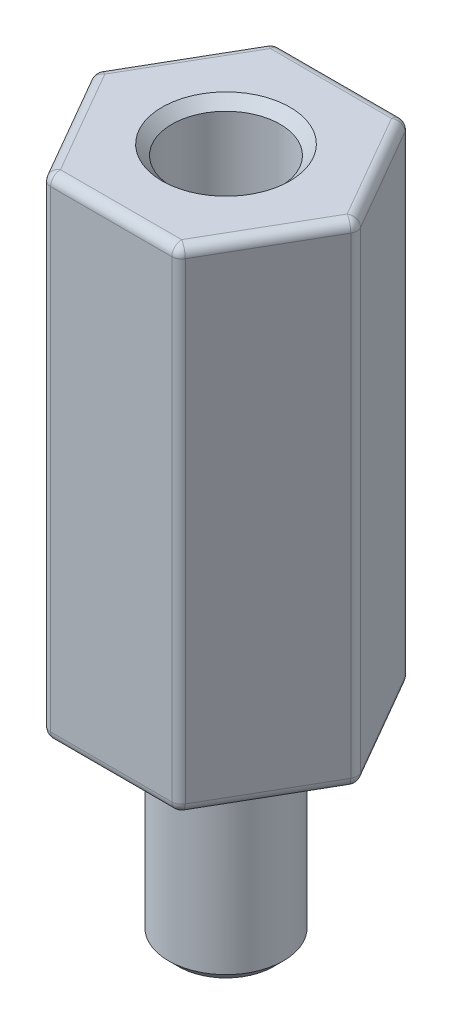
ISO-10303-21;
HEADER;
FILE_DESCRIPTION(('STEP AP214'),'2;1');
FILE_NAME('part.step','',(''),(''),'','','');
FILE_SCHEMA(('AUTOMOTIVE_DESIGN { 1 0 10303 214 1 1 1 1 }'));
ENDSEC;
DATA;
#1=APPLICATION_CONTEXT('core data for automotive mechanical design processes');
#2=APPLICATION_PROTOCOL_DEFINITION('international standard','automotive_design',2000,#1);
#3=PRODUCT_CONTEXT('',#1,'mechanical');
#4=PRODUCT('Part','Part','',(#3));
#5=PRODUCT_RELATED_PRODUCT_CATEGORY('part','',(#4));
#6=PRODUCT_DEFINITION_FORMATION('','',#4);
#7=PRODUCT_DEFINITION_CONTEXT('part definition',#1,'design');
#8=PRODUCT_DEFINITION('design','',#6,#7);
#9=PRODUCT_DEFINITION_SHAPE('','',#8);
#10=(LENGTH_UNIT() NAMED_UNIT(*) SI_UNIT(.MILLI.,.METRE.));
#11=(NAMED_UNIT(*) PLANE_ANGLE_UNIT() SI_UNIT($,.RADIAN.));
#12=(NAMED_UNIT(*) SI_UNIT($,.STERADIAN.) SOLID_ANGLE_UNIT());
#13=UNCERTAINTY_MEASURE_WITH_UNIT(LENGTH_MEASURE(1.E-05),#10,'distance_accuracy_value','');
#14=(GEOMETRIC_REPRESENTATION_CONTEXT(3) GLOBAL_UNCERTAINTY_ASSIGNED_CONTEXT((#13)) GLOBAL_UNIT_ASSIGNED_CONTEXT((#10,
#11,#12)) REPRESENTATION_CONTEXT('',''));
#15=CARTESIAN_POINT('',(0.,0.,0.));
#16=DIRECTION('',(0.,0.,1.));
#17=DIRECTION('',(1.,0.,0.));
#18=AXIS2_PLACEMENT_3D('',#15,#16,#17);
#19=CARTESIAN_POINT('',(0.,15.,0.));
#20=DIRECTION('',(0.,1.,0.));
#21=DIRECTION('',(0.,0.,1.));
#22=AXIS2_PLACEMENT_3D('',#19,#20,#21);
#23=PLANE('',#22);
#24=CARTESIAN_POINT('',(0.,15.,0.));
#25=DIRECTION('',(0.,1.,0.));
#26=DIRECTION('',(0.,0.,1.));
#27=AXIS2_PLACEMENT_3D('',#24,#25,#26);
#28=CIRCLE('',#27,1.95);
#29=CARTESIAN_POINT('',(0.,15.,1.95));
#30=VERTEX_POINT('',#29);
#31=EDGE_CURVE('E319',#30,#30,#28,.F.);
#32=ORIENTED_EDGE('',*,*,#31,.T.);
#33=EDGE_LOOP('',(#32));
#34=FACE_BOUND('',#33,.T.);
#35=DIRECTION('',(-0.5,0.,0.866025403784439));
#36=VECTOR('',#35,1.);
#37=CARTESIAN_POINT('',(-3.6950417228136,15.,0.));
#38=LINE('',#37,#36);
#39=CARTESIAN_POINT('',(-1.8475208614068,15.,-3.2));
#40=VERTEX_POINT('',#39);
#41=CARTESIAN_POINT('',(-3.6950417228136,15.,0.));
#42=VERTEX_POINT('',#41);
#43=EDGE_CURVE('E63',#40,#42,#38,.T.);
#44=ORIENTED_EDGE('',*,*,#43,.T.);
#45=DIRECTION('',(0.5,0.,0.866025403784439));
#46=VECTOR('',#45,1.);
#47=CARTESIAN_POINT('',(-1.8475208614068,15.,3.2));
#48=LINE('',#47,#46);
#49=CARTESIAN_POINT('',(-1.8475208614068,15.,3.2));
#50=VERTEX_POINT('',#49);
#51=EDGE_CURVE('E646',#42,#50,#48,.T.);
#52=ORIENTED_EDGE('',*,*,#51,.T.);
#53=DIRECTION('',(1.,0.,0.));
#54=VECTOR('',#53,1.);
#55=CARTESIAN_POINT('',(1.8475208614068,15.,3.2));
#56=LINE('',#55,#54);
#57=CARTESIAN_POINT('',(1.8475208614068,15.,3.2));
#58=VERTEX_POINT('',#57);
#59=EDGE_CURVE('E633',#50,#58,#56,.T.);
#60=ORIENTED_EDGE('',*,*,#59,.T.);
#61=DIRECTION('',(0.5,0.,-0.866025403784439));
#62=VECTOR('',#61,1.);
#63=CARTESIAN_POINT('',(3.69504172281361,15.,0.));
#64=LINE('',#63,#62);
#65=CARTESIAN_POINT('',(3.69504172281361,15.,0.));
#66=VERTEX_POINT('',#65);
#67=EDGE_CURVE('E636',#58,#66,#64,.T.);
#68=ORIENTED_EDGE('',*,*,#67,.T.);
#69=DIRECTION('',(-0.5,0.,-0.866025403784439));
#70=VECTOR('',#69,1.);
#71=CARTESIAN_POINT('',(1.8475208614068,15.,-3.2));
#72=LINE('',#71,#70);
#73=CARTESIAN_POINT('',(1.8475208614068,15.,-3.2));
#74=VERTEX_POINT('',#73);
#75=EDGE_CURVE('E639',#66,#74,#72,.T.);
#76=ORIENTED_EDGE('',*,*,#75,.T.);
#77=DIRECTION('',(-1.,0.,0.));
#78=VECTOR('',#77,1.);
#79=CARTESIAN_POINT('',(-1.8475208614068,15.,-3.2));
#80=LINE('',#79,#78);
#81=EDGE_CURVE('E68',#74,#40,#80,.T.);
#82=ORIENTED_EDGE('',*,*,#81,.T.);
#83=EDGE_LOOP('',(#44,#52,#60,#68,#76,#82));
#84=FACE_BOUND('',#83,.T.);
#85=ADVANCED_FACE('F47',(#34,#84),#23,.T.);
#86=CARTESIAN_POINT('',(0.,0.,0.));
#87=DIRECTION('',(0.,1.,0.));
#88=DIRECTION('',(0.,0.,1.));
#89=AXIS2_PLACEMENT_3D('',#86,#87,#88);
#90=PLANE('',#89);
#91=CARTESIAN_POINT('',(0.,0.,0.));
#92=DIRECTION('',(0.,1.,0.));
#93=DIRECTION('',(0.,0.,1.));
#94=AXIS2_PLACEMENT_3D('',#91,#92,#93);
#95=CIRCLE('',#94,2.05);
#96=CARTESIAN_POINT('',(0.,0.,2.05));
#97=VERTEX_POINT('',#96);
#98=EDGE_CURVE('E11',#97,#97,#95,.T.);
#99=ORIENTED_EDGE('',*,*,#98,.T.);
#100=EDGE_LOOP('',(#99));
#101=FACE_BOUND('',#100,.T.);
#102=DIRECTION('',(1.,0.,0.));
#103=VECTOR('',#102,1.);
#104=CARTESIAN_POINT('',(0.,0.,3.2));
#105=LINE('',#104,#103);
#106=CARTESIAN_POINT('',(1.8475208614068,0.,3.2));
#107=VERTEX_POINT('',#106);
#108=CARTESIAN_POINT('',(-1.8475208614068,0.,3.2));
#109=VERTEX_POINT('',#108);
#110=EDGE_CURVE('E184',#107,#109,#105,.F.);
#111=ORIENTED_EDGE('',*,*,#110,.T.);
#112=DIRECTION('',(0.5,0.,0.866025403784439));
#113=VECTOR('',#112,1.);
#114=CARTESIAN_POINT('',(-2.7712812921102,0.,1.6));
#115=LINE('',#114,#113);
#116=CARTESIAN_POINT('',(-3.6950417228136,0.,0.));
#117=VERTEX_POINT('',#116);
#118=EDGE_CURVE('E212',#109,#117,#115,.F.);
#119=ORIENTED_EDGE('',*,*,#118,.T.);
#120=DIRECTION('',(-0.5,0.,0.866025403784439));
#121=VECTOR('',#120,1.);
#122=CARTESIAN_POINT('',(-2.7712812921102,0.,-1.6));
#123=LINE('',#122,#121);
#124=CARTESIAN_POINT('',(-1.8475208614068,0.,-3.2));
#125=VERTEX_POINT('',#124);
#126=EDGE_CURVE('E574',#117,#125,#123,.F.);
#127=ORIENTED_EDGE('',*,*,#126,.T.);
#128=DIRECTION('',(-1.,0.,0.));
#129=VECTOR('',#128,1.);
#130=CARTESIAN_POINT('',(0.,0.,-3.2));
#131=LINE('',#130,#129);
#132=CARTESIAN_POINT('',(1.8475208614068,0.,-3.2));
#133=VERTEX_POINT('',#132);
#134=EDGE_CURVE('E571',#125,#133,#131,.F.);
#135=ORIENTED_EDGE('',*,*,#134,.T.);
#136=DIRECTION('',(-0.5,0.,-0.866025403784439));
#137=VECTOR('',#136,1.);
#138=CARTESIAN_POINT('',(2.7712812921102,0.,-1.6));
#139=LINE('',#138,#137);
#140=CARTESIAN_POINT('',(3.69504172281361,0.,0.));
#141=VERTEX_POINT('',#140);
#142=EDGE_CURVE('E568',#133,#141,#139,.F.);
#143=ORIENTED_EDGE('',*,*,#142,.T.);
#144=DIRECTION('',(0.5,0.,-0.866025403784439));
#145=VECTOR('',#144,1.);
#146=CARTESIAN_POINT('',(2.7712812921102,0.,1.6));
#147=LINE('',#146,#145);
#148=EDGE_CURVE('E565',#141,#107,#147,.F.);
#149=ORIENTED_EDGE('',*,*,#148,.T.);
#150=EDGE_LOOP('',(#111,#119,#127,#135,#143,#149));
#151=FACE_BOUND('',#150,.T.);
#152=ADVANCED_FACE('F339',(#101,#151),#90,.F.);
#153=CARTESIAN_POINT('',(2.02072594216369,15.,-3.5));
#154=DIRECTION('',(0.,0.,1.));
#155=DIRECTION('',(1.,0.,0.));
#156=AXIS2_PLACEMENT_3D('',#153,#154,#155);
#157=PLANE('',#156);
#158=DIRECTION('',(0.,-1.,0.));
#159=VECTOR('',#158,1.);
#160=CARTESIAN_POINT('',(1.8475208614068,15.,-3.5));
#161=LINE('',#160,#159);
#162=CARTESIAN_POINT('',(1.8475208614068,14.7,-3.5));
#163=VERTEX_POINT('',#162);
#164=CARTESIAN_POINT('',(1.8475208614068,0.3,-3.5));
#165=VERTEX_POINT('',#164);
#166=EDGE_CURVE('E521',#163,#165,#161,.T.);
#167=ORIENTED_EDGE('',*,*,#166,.T.);
#168=DIRECTION('',(-1.,0.,0.));
#169=VECTOR('',#168,1.);
#170=CARTESIAN_POINT('',(2.02072594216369,0.3,-3.5));
#171=LINE('',#170,#169);
#172=CARTESIAN_POINT('',(-1.8475208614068,0.3,-3.5));
#173=VERTEX_POINT('',#172);
#174=EDGE_CURVE('E600',#165,#173,#171,.T.);
#175=ORIENTED_EDGE('',*,*,#174,.T.);
#176=DIRECTION('',(0.,-1.,0.));
#177=VECTOR('',#176,1.);
#178=CARTESIAN_POINT('',(-1.8475208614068,15.,-3.5));
#179=LINE('',#178,#177);
#180=CARTESIAN_POINT('',(-1.8475208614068,14.7,-3.5));
#181=VERTEX_POINT('',#180);
#182=EDGE_CURVE('E517',#173,#181,#179,.F.);
#183=ORIENTED_EDGE('',*,*,#182,.T.);
#184=DIRECTION('',(-1.,0.,0.));
#185=VECTOR('',#184,1.);
#186=CARTESIAN_POINT('',(1.8475208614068,14.7,-3.5));
#187=LINE('',#186,#185);
#188=EDGE_CURVE('E597',#181,#163,#187,.F.);
#189=ORIENTED_EDGE('',*,*,#188,.T.);
#190=EDGE_LOOP('',(#167,#175,#183,#189));
#191=FACE_BOUND('',#190,.T.);
#192=ADVANCED_FACE('F345',(#191),#157,.F.);
#193=CARTESIAN_POINT('',(-2.02072594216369,15.,-3.5));
#194=DIRECTION('',(0.866025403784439,0.,0.5));
#195=DIRECTION('',(0.5,0.,-0.866025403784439));
#196=AXIS2_PLACEMENT_3D('',#193,#194,#195);
#197=PLANE('',#196);
#198=DIRECTION('',(0.,-1.,0.));
#199=VECTOR('',#198,1.);
#200=CARTESIAN_POINT('',(-2.10732848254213,15.,-3.35));
#201=LINE('',#200,#199);
#202=CARTESIAN_POINT('',(-2.10732848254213,14.7,-3.35));
#203=VERTEX_POINT('',#202);
#204=CARTESIAN_POINT('',(-2.10732848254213,0.3,-3.35));
#205=VERTEX_POINT('',#204);
#206=EDGE_CURVE('E198',#203,#205,#201,.T.);
#207=ORIENTED_EDGE('',*,*,#206,.T.);
#208=DIRECTION('',(-0.5,0.,0.866025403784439));
#209=VECTOR('',#208,1.);
#210=CARTESIAN_POINT('',(-2.02072594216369,0.3,-3.5));
#211=LINE('',#210,#209);
#212=CARTESIAN_POINT('',(-3.95484934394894,0.3,-0.149999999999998));
#213=VERTEX_POINT('',#212);
#214=EDGE_CURVE('E588',#205,#213,#211,.T.);
#215=ORIENTED_EDGE('',*,*,#214,.T.);
#216=DIRECTION('',(0.,-1.,0.));
#217=VECTOR('',#216,1.);
#218=CARTESIAN_POINT('',(-3.95484934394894,15.,-0.149999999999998));
#219=LINE('',#218,#217);
#220=CARTESIAN_POINT('',(-3.95484934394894,14.7,-0.149999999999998));
#221=VERTEX_POINT('',#220);
#222=EDGE_CURVE('E543',#213,#221,#219,.F.);
#223=ORIENTED_EDGE('',*,*,#222,.T.);
#224=DIRECTION('',(-0.5,0.,0.866025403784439));
#225=VECTOR('',#224,1.);
#226=CARTESIAN_POINT('',(-2.10732848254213,14.7,-3.35));
#227=LINE('',#226,#225);
#228=EDGE_CURVE('E585',#221,#203,#227,.F.);
#229=ORIENTED_EDGE('',*,*,#228,.T.);
#230=EDGE_LOOP('',(#207,#215,#223,#229));
#231=FACE_BOUND('',#230,.T.);
#232=ADVANCED_FACE('F366',(#231),#197,.F.);
#233=CARTESIAN_POINT('',(-4.04145188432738,15.,0.));
#234=DIRECTION('',(0.866025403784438,0.,-0.5));
#235=DIRECTION('',(-0.5,0.,-0.866025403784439));
#236=AXIS2_PLACEMENT_3D('',#233,#234,#235);
#237=PLANE('',#236);
#238=DIRECTION('',(0.,-1.,0.));
#239=VECTOR('',#238,1.);
#240=CARTESIAN_POINT('',(-3.95484934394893,15.,0.150000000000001));
#241=LINE('',#240,#239);
#242=CARTESIAN_POINT('',(-3.95484934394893,14.7,0.150000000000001));
#243=VERTEX_POINT('',#242);
#244=CARTESIAN_POINT('',(-3.95484934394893,0.3,0.150000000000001));
#245=VERTEX_POINT('',#244);
#246=EDGE_CURVE('E179',#243,#245,#241,.T.);
#247=ORIENTED_EDGE('',*,*,#246,.T.);
#248=DIRECTION('',(0.5,0.,0.866025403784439));
#249=VECTOR('',#248,1.);
#250=CARTESIAN_POINT('',(-4.04145188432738,0.3,0.));
#251=LINE('',#250,#249);
#252=CARTESIAN_POINT('',(-2.10732848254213,0.3,3.35));
#253=VERTEX_POINT('',#252);
#254=EDGE_CURVE('E174',#245,#253,#251,.T.);
#255=ORIENTED_EDGE('',*,*,#254,.T.);
#256=DIRECTION('',(0.,-1.,0.));
#257=VECTOR('',#256,1.);
#258=CARTESIAN_POINT('',(-2.10732848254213,15.,3.35));
#259=LINE('',#258,#257);
#260=CARTESIAN_POINT('',(-2.10732848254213,14.7,3.35));
#261=VERTEX_POINT('',#260);
#262=EDGE_CURVE('E177',#253,#261,#259,.F.);
#263=ORIENTED_EDGE('',*,*,#262,.T.);
#264=DIRECTION('',(0.5,0.,0.866025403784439));
#265=VECTOR('',#264,1.);
#266=CARTESIAN_POINT('',(-3.95484934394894,14.7,0.150000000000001));
#267=LINE('',#266,#265);
#268=EDGE_CURVE('E185',#261,#243,#267,.F.);
#269=ORIENTED_EDGE('',*,*,#268,.T.);
#270=EDGE_LOOP('',(#247,#255,#263,#269));
#271=FACE_BOUND('',#270,.T.);
#272=ADVANCED_FACE('F176',(#271),#237,.F.);
#273=CARTESIAN_POINT('',(-2.02072594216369,15.,3.5));
#274=DIRECTION('',(0.,0.,-1.));
#275=DIRECTION('',(-1.,0.,0.));
#276=AXIS2_PLACEMENT_3D('',#273,#274,#275);
#277=PLANE('',#276);
#278=DIRECTION('',(0.,-1.,0.));
#279=VECTOR('',#278,1.);
#280=CARTESIAN_POINT('',(-1.8475208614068,15.,3.5));
#281=LINE('',#280,#279);
#282=CARTESIAN_POINT('',(-1.8475208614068,14.7,3.5));
#283=VERTEX_POINT('',#282);
#284=CARTESIAN_POINT('',(-1.8475208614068,0.3,3.5));
#285=VERTEX_POINT('',#284);
#286=EDGE_CURVE('E556',#283,#285,#281,.T.);
#287=ORIENTED_EDGE('',*,*,#286,.T.);
#288=DIRECTION('',(1.,0.,0.));
#289=VECTOR('',#288,1.);
#290=CARTESIAN_POINT('',(-2.02072594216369,0.3,3.5));
#291=LINE('',#290,#289);
#292=CARTESIAN_POINT('',(1.8475208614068,0.3,3.5));
#293=VERTEX_POINT('',#292);
#294=EDGE_CURVE('E224',#285,#293,#291,.T.);
#295=ORIENTED_EDGE('',*,*,#294,.T.);
#296=DIRECTION('',(0.,-1.,0.));
#297=VECTOR('',#296,1.);
#298=CARTESIAN_POINT('',(1.8475208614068,15.,3.5));
#299=LINE('',#298,#297);
#300=CARTESIAN_POINT('',(1.8475208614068,14.7,3.5));
#301=VERTEX_POINT('',#300);
#302=EDGE_CURVE('E552',#293,#301,#299,.F.);
#303=ORIENTED_EDGE('',*,*,#302,.T.);
#304=DIRECTION('',(1.,0.,0.));
#305=VECTOR('',#304,1.);
#306=CARTESIAN_POINT('',(-1.8475208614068,14.7,3.5));
#307=LINE('',#306,#305);
#308=EDGE_CURVE('E648',#301,#283,#307,.F.);
#309=ORIENTED_EDGE('',*,*,#308,.T.);
#310=EDGE_LOOP('',(#287,#295,#303,#309));
#311=FACE_BOUND('',#310,.T.);
#312=ADVANCED_FACE('F359',(#311),#277,.F.);
#313=CARTESIAN_POINT('',(2.02072594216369,15.,3.5));
#314=DIRECTION('',(-0.866025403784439,0.,-0.5));
#315=DIRECTION('',(-0.5,0.,0.866025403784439));
#316=AXIS2_PLACEMENT_3D('',#313,#314,#315);
#317=PLANE('',#316);
#318=DIRECTION('',(0.,-1.,0.));
#319=VECTOR('',#318,1.);
#320=CARTESIAN_POINT('',(2.10732848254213,15.,3.35));
#321=LINE('',#320,#319);
#322=CARTESIAN_POINT('',(2.10732848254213,14.7,3.35));
#323=VERTEX_POINT('',#322);
#324=CARTESIAN_POINT('',(2.10732848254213,0.3,3.35));
#325=VERTEX_POINT('',#324);
#326=EDGE_CURVE('E535',#323,#325,#321,.T.);
#327=ORIENTED_EDGE('',*,*,#326,.T.);
#328=DIRECTION('',(0.5,0.,-0.866025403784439));
#329=VECTOR('',#328,1.);
#330=CARTESIAN_POINT('',(2.02072594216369,0.3,3.5));
#331=LINE('',#330,#329);
#332=CARTESIAN_POINT('',(3.95484934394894,0.3,0.15));
#333=VERTEX_POINT('',#332);
#334=EDGE_CURVE('E624',#325,#333,#331,.T.);
#335=ORIENTED_EDGE('',*,*,#334,.T.);
#336=DIRECTION('',(0.,-1.,0.));
#337=VECTOR('',#336,1.);
#338=CARTESIAN_POINT('',(3.95484934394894,15.,0.15));
#339=LINE('',#338,#337);
#340=CARTESIAN_POINT('',(3.95484934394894,14.7,0.15));
#341=VERTEX_POINT('',#340);
#342=EDGE_CURVE('E539',#333,#341,#339,.F.);
#343=ORIENTED_EDGE('',*,*,#342,.T.);
#344=DIRECTION('',(0.5,0.,-0.866025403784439));
#345=VECTOR('',#344,1.);
#346=CARTESIAN_POINT('',(2.10732848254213,14.7,3.35));
#347=LINE('',#346,#345);
#348=EDGE_CURVE('E621',#341,#323,#347,.F.);
#349=ORIENTED_EDGE('',*,*,#348,.T.);
#350=EDGE_LOOP('',(#327,#335,#343,#349));
#351=FACE_BOUND('',#350,.T.);
#352=ADVANCED_FACE('F355',(#351),#317,.F.);
#353=CARTESIAN_POINT('',(4.04145188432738,15.,0.));
#354=DIRECTION('',(-0.866025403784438,0.,0.5));
#355=DIRECTION('',(0.5,0.,0.866025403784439));
#356=AXIS2_PLACEMENT_3D('',#353,#354,#355);
#357=PLANE('',#356);
#358=DIRECTION('',(0.,-1.,0.));
#359=VECTOR('',#358,1.);
#360=CARTESIAN_POINT('',(3.95484934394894,15.,-0.15));
#361=LINE('',#360,#359);
#362=CARTESIAN_POINT('',(3.95484934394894,14.7,-0.15));
#363=VERTEX_POINT('',#362);
#364=CARTESIAN_POINT('',(3.95484934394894,0.3,-0.15));
#365=VERTEX_POINT('',#364);
#366=EDGE_CURVE('E527',#363,#365,#361,.T.);
#367=ORIENTED_EDGE('',*,*,#366,.T.);
#368=DIRECTION('',(-0.5,0.,-0.866025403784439));
#369=VECTOR('',#368,1.);
#370=CARTESIAN_POINT('',(4.04145188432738,0.3,0.));
#371=LINE('',#370,#369);
#372=CARTESIAN_POINT('',(2.10732848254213,0.3,-3.35));
#373=VERTEX_POINT('',#372);
#374=EDGE_CURVE('E612',#365,#373,#371,.T.);
#375=ORIENTED_EDGE('',*,*,#374,.T.);
#376=DIRECTION('',(0.,-1.,0.));
#377=VECTOR('',#376,1.);
#378=CARTESIAN_POINT('',(2.10732848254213,15.,-3.35));
#379=LINE('',#378,#377);
#380=CARTESIAN_POINT('',(2.10732848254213,14.7,-3.35));
#381=VERTEX_POINT('',#380);
#382=EDGE_CURVE('E531',#373,#381,#379,.F.);
#383=ORIENTED_EDGE('',*,*,#382,.T.);
#384=DIRECTION('',(-0.5,0.,-0.866025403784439));
#385=VECTOR('',#384,1.);
#386=CARTESIAN_POINT('',(3.95484934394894,14.7,-0.15));
#387=LINE('',#386,#385);
#388=EDGE_CURVE('E609',#381,#363,#387,.F.);
#389=ORIENTED_EDGE('',*,*,#388,.T.);
#390=EDGE_LOOP('',(#367,#375,#383,#389));
#391=FACE_BOUND('',#390,.T.);
#392=ADVANCED_FACE('F352',(#391),#357,.F.);
#393=CARTESIAN_POINT('',(0.,15.,0.));
#394=DIRECTION('',(0.,-1.,0.));
#395=DIRECTION('',(0.,0.,-1.));
#396=AXIS2_PLACEMENT_3D('',#393,#394,#395);
#397=CYLINDRICAL_SURFACE('',#396,1.65);
#398=CARTESIAN_POINT('',(0.,14.7,0.));
#399=DIRECTION('',(0.,1.,0.));
#400=DIRECTION('',(0.,0.,1.));
#401=AXIS2_PLACEMENT_3D('',#398,#399,#400);
#402=CIRCLE('',#401,1.65);
#403=CARTESIAN_POINT('',(0.,14.7,1.65));
#404=VERTEX_POINT('',#403);
#405=EDGE_CURVE('E315',#404,#404,#402,.T.);
#406=ORIENTED_EDGE('',*,*,#405,.T.);
#407=EDGE_LOOP('',(#406));
#408=FACE_BOUND('',#407,.T.);
#409=CARTESIAN_POINT('',(0.,0.,0.));
#410=DIRECTION('',(0.,1.,0.));
#411=DIRECTION('',(0.,0.,1.));
#412=AXIS2_PLACEMENT_3D('',#409,#410,#411);
#413=CIRCLE('',#412,1.65);
#414=CARTESIAN_POINT('',(0.,0.,1.65));
#415=VERTEX_POINT('',#414);
#416=EDGE_CURVE('E265',#415,#415,#413,.T.);
#417=ORIENTED_EDGE('',*,*,#416,.F.);
#418=EDGE_LOOP('',(#417));
#419=FACE_BOUND('',#418,.T.);
#420=ADVANCED_FACE('F349',(#408,#419),#397,.F.);
#421=CARTESIAN_POINT('',(1.8475208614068,15.,-3.2));
#422=DIRECTION('',(0.,-1.,0.));
#423=DIRECTION('',(0.,0.,-1.));
#424=AXIS2_PLACEMENT_3D('',#421,#422,#423);
#425=CYLINDRICAL_SURFACE('',#424,0.3);
#426=ORIENTED_EDGE('',*,*,#382,.F.);
#427=CARTESIAN_POINT('',(1.8475208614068,0.3,-3.2));
#428=DIRECTION('',(0.,-1.,0.));
#429=DIRECTION('',(0.,0.,-1.));
#430=AXIS2_PLACEMENT_3D('',#427,#428,#429);
#431=CIRCLE('',#430,0.3);
#432=EDGE_CURVE('E606',#373,#165,#431,.F.);
#433=ORIENTED_EDGE('',*,*,#432,.T.);
#434=ORIENTED_EDGE('',*,*,#166,.F.);
#435=CARTESIAN_POINT('',(1.8475208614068,14.7,-3.2));
#436=DIRECTION('',(0.,-1.,0.));
#437=DIRECTION('',(0.,0.,-1.));
#438=AXIS2_PLACEMENT_3D('',#435,#436,#437);
#439=CIRCLE('',#438,0.3);
#440=EDGE_CURVE('E603',#163,#381,#439,.T.);
#441=ORIENTED_EDGE('',*,*,#440,.T.);
#442=EDGE_LOOP('',(#426,#433,#434,#441));
#443=FACE_BOUND('',#442,.T.);
#444=ADVANCED_FACE('F373',(#443),#425,.T.);
#445=CARTESIAN_POINT('',(3.69504172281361,15.,0.));
#446=DIRECTION('',(0.,-1.,0.));
#447=DIRECTION('',(0.,0.,-1.));
#448=AXIS2_PLACEMENT_3D('',#445,#446,#447);
#449=CYLINDRICAL_SURFACE('',#448,0.3);
#450=ORIENTED_EDGE('',*,*,#342,.F.);
#451=CARTESIAN_POINT('',(3.69504172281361,0.3,0.));
#452=DIRECTION('',(0.,-1.,0.));
#453=DIRECTION('',(0.,0.,-1.));
#454=AXIS2_PLACEMENT_3D('',#451,#452,#453);
#455=CIRCLE('',#454,0.3);
#456=EDGE_CURVE('E618',#333,#365,#455,.F.);
#457=ORIENTED_EDGE('',*,*,#456,.T.);
#458=ORIENTED_EDGE('',*,*,#366,.F.);
#459=CARTESIAN_POINT('',(3.69504172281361,14.7,0.));
#460=DIRECTION('',(0.,-1.,0.));
#461=DIRECTION('',(0.,0.,-1.));
#462=AXIS2_PLACEMENT_3D('',#459,#460,#461);
#463=CIRCLE('',#462,0.3);
#464=EDGE_CURVE('E615',#363,#341,#463,.T.);
#465=ORIENTED_EDGE('',*,*,#464,.T.);
#466=EDGE_LOOP('',(#450,#457,#458,#465));
#467=FACE_BOUND('',#466,.T.);
#468=ADVANCED_FACE('F376',(#467),#449,.T.);
#469=CARTESIAN_POINT('',(-1.8475208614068,15.,-3.2));
#470=DIRECTION('',(0.,-1.,0.));
#471=DIRECTION('',(0.,0.,-1.));
#472=AXIS2_PLACEMENT_3D('',#469,#470,#471);
#473=CYLINDRICAL_SURFACE('',#472,0.3);
#474=ORIENTED_EDGE('',*,*,#182,.F.);
#475=CARTESIAN_POINT('',(-1.8475208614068,0.3,-3.2));
#476=DIRECTION('',(0.,-1.,0.));
#477=DIRECTION('',(0.,0.,-1.));
#478=AXIS2_PLACEMENT_3D('',#475,#476,#477);
#479=CIRCLE('',#478,0.3);
#480=EDGE_CURVE('E594',#173,#205,#479,.F.);
#481=ORIENTED_EDGE('',*,*,#480,.T.);
#482=ORIENTED_EDGE('',*,*,#206,.F.);
#483=CARTESIAN_POINT('',(-1.8475208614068,14.7,-3.2));
#484=DIRECTION('',(0.,-1.,0.));
#485=DIRECTION('',(0.,0.,-1.));
#486=AXIS2_PLACEMENT_3D('',#483,#484,#485);
#487=CIRCLE('',#486,0.3);
#488=EDGE_CURVE('E591',#203,#181,#487,.T.);
#489=ORIENTED_EDGE('',*,*,#488,.T.);
#490=EDGE_LOOP('',(#474,#481,#482,#489));
#491=FACE_BOUND('',#490,.T.);
#492=ADVANCED_FACE('F380',(#491),#473,.T.);
#493=CARTESIAN_POINT('',(-3.6950417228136,15.,0.));
#494=DIRECTION('',(0.,-1.,0.));
#495=DIRECTION('',(0.,0.,-1.));
#496=AXIS2_PLACEMENT_3D('',#493,#494,#495);
#497=CYLINDRICAL_SURFACE('',#496,0.3);
#498=ORIENTED_EDGE('',*,*,#222,.F.);
#499=CARTESIAN_POINT('',(-3.6950417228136,0.3,0.));
#500=DIRECTION('',(0.,-1.,0.));
#501=DIRECTION('',(0.,0.,-1.));
#502=AXIS2_PLACEMENT_3D('',#499,#500,#501);
#503=CIRCLE('',#502,0.3);
#504=EDGE_CURVE('E582',#213,#245,#503,.F.);
#505=ORIENTED_EDGE('',*,*,#504,.T.);
#506=ORIENTED_EDGE('',*,*,#246,.F.);
#507=CARTESIAN_POINT('',(-3.6950417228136,14.7,0.));
#508=DIRECTION('',(0.,-1.,0.));
#509=DIRECTION('',(0.,0.,-1.));
#510=AXIS2_PLACEMENT_3D('',#507,#508,#509);
#511=CIRCLE('',#510,0.3);
#512=EDGE_CURVE('E579',#243,#221,#511,.T.);
#513=ORIENTED_EDGE('',*,*,#512,.T.);
#514=EDGE_LOOP('',(#498,#505,#506,#513));
#515=FACE_BOUND('',#514,.T.);
#516=ADVANCED_FACE('F384',(#515),#497,.T.);
#517=CARTESIAN_POINT('',(-1.8475208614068,15.,3.2));
#518=DIRECTION('',(0.,-1.,0.));
#519=DIRECTION('',(0.,0.,-1.));
#520=AXIS2_PLACEMENT_3D('',#517,#518,#519);
#521=CYLINDRICAL_SURFACE('',#520,0.3);
#522=ORIENTED_EDGE('',*,*,#262,.F.);
#523=CARTESIAN_POINT('',(-1.8475208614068,0.3,3.2));
#524=DIRECTION('',(0.,-1.,0.));
#525=DIRECTION('',(0.,0.,-1.));
#526=AXIS2_PLACEMENT_3D('',#523,#524,#525);
#527=CIRCLE('',#526,0.3);
#528=EDGE_CURVE('E193',#253,#285,#527,.F.);
#529=ORIENTED_EDGE('',*,*,#528,.T.);
#530=ORIENTED_EDGE('',*,*,#286,.F.);
#531=CARTESIAN_POINT('',(-1.8475208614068,14.7,3.2));
#532=DIRECTION('',(0.,-1.,0.));
#533=DIRECTION('',(0.,0.,-1.));
#534=AXIS2_PLACEMENT_3D('',#531,#532,#533);
#535=CIRCLE('',#534,0.3);
#536=EDGE_CURVE('E196',#283,#261,#535,.T.);
#537=ORIENTED_EDGE('',*,*,#536,.T.);
#538=EDGE_LOOP('',(#522,#529,#530,#537));
#539=FACE_BOUND('',#538,.T.);
#540=ADVANCED_FACE('F191',(#539),#521,.T.);
#541=CARTESIAN_POINT('',(1.8475208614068,15.,3.2));
#542=DIRECTION('',(0.,-1.,0.));
#543=DIRECTION('',(0.,0.,-1.));
#544=AXIS2_PLACEMENT_3D('',#541,#542,#543);
#545=CYLINDRICAL_SURFACE('',#544,0.3);
#546=ORIENTED_EDGE('',*,*,#302,.F.);
#547=CARTESIAN_POINT('',(1.8475208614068,0.3,3.2));
#548=DIRECTION('',(0.,-1.,0.));
#549=DIRECTION('',(0.,0.,-1.));
#550=AXIS2_PLACEMENT_3D('',#547,#548,#549);
#551=CIRCLE('',#550,0.3);
#552=EDGE_CURVE('E630',#293,#325,#551,.F.);
#553=ORIENTED_EDGE('',*,*,#552,.T.);
#554=ORIENTED_EDGE('',*,*,#326,.F.);
#555=CARTESIAN_POINT('',(1.8475208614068,14.7,3.2));
#556=DIRECTION('',(0.,-1.,0.));
#557=DIRECTION('',(0.,0.,-1.));
#558=AXIS2_PLACEMENT_3D('',#555,#556,#557);
#559=CIRCLE('',#558,0.3);
#560=EDGE_CURVE('E627',#323,#301,#559,.T.);
#561=ORIENTED_EDGE('',*,*,#560,.T.);
#562=EDGE_LOOP('',(#546,#553,#554,#561));
#563=FACE_BOUND('',#562,.T.);
#564=ADVANCED_FACE('F391',(#563),#545,.T.);
#565=CARTESIAN_POINT('',(1.8475208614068,0.3,-3.2));
#566=DIRECTION('',(0.,1.,0.));
#567=DIRECTION('',(0.,0.,1.));
#568=AXIS2_PLACEMENT_3D('',#565,#566,#567);
#569=SPHERICAL_SURFACE('',#568,0.3);
#570=CARTESIAN_POINT('',(1.8475208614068,0.3,-3.2));
#571=DIRECTION('',(-1.,0.,0.));
#572=DIRECTION('',(0.,0.,1.));
#573=AXIS2_PLACEMENT_3D('',#570,#571,#572);
#574=CIRCLE('',#573,0.3);
#575=EDGE_CURVE('E257',#165,#133,#574,.T.);
#576=ORIENTED_EDGE('',*,*,#575,.F.);
#577=ORIENTED_EDGE('',*,*,#432,.F.);
#578=CARTESIAN_POINT('',(1.8475208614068,0.3,-3.2));
#579=DIRECTION('',(0.5,0.,0.866025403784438));
#580=DIRECTION('',(0.866025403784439,0.,-0.5));
#581=AXIS2_PLACEMENT_3D('',#578,#579,#580);
#582=CIRCLE('',#581,0.3);
#583=EDGE_CURVE('E261',#133,#373,#582,.T.);
#584=ORIENTED_EDGE('',*,*,#583,.F.);
#585=EDGE_LOOP('',(#576,#577,#584));
#586=FACE_BOUND('',#585,.T.);
#587=ADVANCED_FACE('F394',(#586),#569,.T.);
#588=CARTESIAN_POINT('',(3.78164426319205,0.3,0.149999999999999));
#589=DIRECTION('',(-0.5,0.,-0.866025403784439));
#590=DIRECTION('',(-0.866025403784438,0.,0.5));
#591=AXIS2_PLACEMENT_3D('',#588,#589,#590);
#592=CYLINDRICAL_SURFACE('',#591,0.3);
#593=ORIENTED_EDGE('',*,*,#583,.T.);
#594=ORIENTED_EDGE('',*,*,#374,.F.);
#595=CARTESIAN_POINT('',(3.6950417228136,0.3,0.));
#596=DIRECTION('',(0.5,0.,0.866025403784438));
#597=DIRECTION('',(0.866025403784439,0.,-0.5));
#598=AXIS2_PLACEMENT_3D('',#595,#596,#597);
#599=CIRCLE('',#598,0.3);
#600=EDGE_CURVE('E253',#141,#365,#599,.T.);
#601=ORIENTED_EDGE('',*,*,#600,.F.);
#602=ORIENTED_EDGE('',*,*,#142,.F.);
#603=EDGE_LOOP('',(#593,#594,#601,#602));
#604=FACE_BOUND('',#603,.T.);
#605=ADVANCED_FACE('F432',(#604),#592,.T.);
#606=CARTESIAN_POINT('',(2.02072594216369,0.3,-3.2));
#607=DIRECTION('',(-1.,0.,0.));
#608=DIRECTION('',(0.,0.,1.));
#609=AXIS2_PLACEMENT_3D('',#606,#607,#608);
#610=CYLINDRICAL_SURFACE('',#609,0.3);
#611=ORIENTED_EDGE('',*,*,#575,.T.);
#612=ORIENTED_EDGE('',*,*,#134,.F.);
#613=CARTESIAN_POINT('',(-1.8475208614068,0.3,-3.2));
#614=DIRECTION('',(-1.,0.,0.));
#615=DIRECTION('',(0.,-1.,0.));
#616=AXIS2_PLACEMENT_3D('',#613,#614,#615);
#617=CIRCLE('',#616,0.3);
#618=EDGE_CURVE('E249',#173,#125,#617,.T.);
#619=ORIENTED_EDGE('',*,*,#618,.F.);
#620=ORIENTED_EDGE('',*,*,#174,.F.);
#621=EDGE_LOOP('',(#611,#612,#619,#620));
#622=FACE_BOUND('',#621,.T.);
#623=ADVANCED_FACE('F428',(#622),#610,.T.);
#624=CARTESIAN_POINT('',(3.69504172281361,0.3,0.));
#625=DIRECTION('',(0.,1.,0.));
#626=DIRECTION('',(0.,0.,1.));
#627=AXIS2_PLACEMENT_3D('',#624,#625,#626);
#628=SPHERICAL_SURFACE('',#627,0.3);
#629=ORIENTED_EDGE('',*,*,#600,.T.);
#630=ORIENTED_EDGE('',*,*,#456,.F.);
#631=CARTESIAN_POINT('',(3.69504172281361,0.3,0.));
#632=DIRECTION('',(-0.499999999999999,0.,0.866025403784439));
#633=DIRECTION('',(0.866025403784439,0.,0.499999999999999));
#634=AXIS2_PLACEMENT_3D('',#631,#632,#633);
#635=CIRCLE('',#634,0.3);
#636=EDGE_CURVE('E245',#141,#333,#635,.T.);
#637=ORIENTED_EDGE('',*,*,#636,.F.);
#638=EDGE_LOOP('',(#629,#630,#637));
#639=FACE_BOUND('',#638,.T.);
#640=ADVANCED_FACE('F424',(#639),#628,.T.);
#641=CARTESIAN_POINT('',(-1.8475208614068,0.3,-3.2));
#642=DIRECTION('',(0.,1.,0.));
#643=DIRECTION('',(0.,0.,1.));
#644=AXIS2_PLACEMENT_3D('',#641,#642,#643);
#645=SPHERICAL_SURFACE('',#644,0.3);
#646=ORIENTED_EDGE('',*,*,#480,.F.);
#647=ORIENTED_EDGE('',*,*,#618,.T.);
#648=CARTESIAN_POINT('',(-1.8475208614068,0.3,-3.2));
#649=DIRECTION('',(-0.5,0.,0.866025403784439));
#650=DIRECTION('',(0.866025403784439,0.,0.5));
#651=AXIS2_PLACEMENT_3D('',#648,#649,#650);
#652=CIRCLE('',#651,0.3);
#653=EDGE_CURVE('E241',#205,#125,#652,.T.);
#654=ORIENTED_EDGE('',*,*,#653,.F.);
#655=EDGE_LOOP('',(#646,#647,#654));
#656=FACE_BOUND('',#655,.T.);
#657=ADVANCED_FACE('F420',(#656),#645,.T.);
#658=CARTESIAN_POINT('',(1.76091832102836,0.3,3.35));
#659=DIRECTION('',(0.5,0.,-0.866025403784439));
#660=DIRECTION('',(-0.866025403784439,0.,-0.5));
#661=AXIS2_PLACEMENT_3D('',#658,#659,#660);
#662=CYLINDRICAL_SURFACE('',#661,0.3);
#663=ORIENTED_EDGE('',*,*,#636,.T.);
#664=ORIENTED_EDGE('',*,*,#334,.F.);
#665=CARTESIAN_POINT('',(1.8475208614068,0.3,3.2));
#666=DIRECTION('',(-0.5,0.,0.866025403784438));
#667=DIRECTION('',(0.866025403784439,0.,0.5));
#668=AXIS2_PLACEMENT_3D('',#665,#666,#667);
#669=CIRCLE('',#668,0.3);
#670=EDGE_CURVE('E237',#107,#325,#669,.T.);
#671=ORIENTED_EDGE('',*,*,#670,.F.);
#672=ORIENTED_EDGE('',*,*,#148,.F.);
#673=EDGE_LOOP('',(#663,#664,#671,#672));
#674=FACE_BOUND('',#673,.T.);
#675=ADVANCED_FACE('F416',(#674),#662,.T.);
#676=CARTESIAN_POINT('',(-1.76091832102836,0.3,-3.35));
#677=DIRECTION('',(-0.5,0.,0.866025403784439));
#678=DIRECTION('',(0.866025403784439,0.,0.5));
#679=AXIS2_PLACEMENT_3D('',#676,#677,#678);
#680=CYLINDRICAL_SURFACE('',#679,0.3);
#681=ORIENTED_EDGE('',*,*,#653,.T.);
#682=ORIENTED_EDGE('',*,*,#126,.F.);
#683=CARTESIAN_POINT('',(-3.6950417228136,0.3,0.));
#684=DIRECTION('',(-0.5,0.,0.866025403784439));
#685=DIRECTION('',(0.866025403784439,0.,0.5));
#686=AXIS2_PLACEMENT_3D('',#683,#684,#685);
#687=CIRCLE('',#686,0.3);
#688=EDGE_CURVE('E233',#213,#117,#687,.T.);
#689=ORIENTED_EDGE('',*,*,#688,.F.);
#690=ORIENTED_EDGE('',*,*,#214,.F.);
#691=EDGE_LOOP('',(#681,#682,#689,#690));
#692=FACE_BOUND('',#691,.T.);
#693=ADVANCED_FACE('F412',(#692),#680,.T.);
#694=CARTESIAN_POINT('',(1.8475208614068,0.3,3.2));
#695=DIRECTION('',(0.,1.,0.));
#696=DIRECTION('',(0.,0.,1.));
#697=AXIS2_PLACEMENT_3D('',#694,#695,#696);
#698=SPHERICAL_SURFACE('',#697,0.3);
#699=ORIENTED_EDGE('',*,*,#670,.T.);
#700=ORIENTED_EDGE('',*,*,#552,.F.);
#701=CARTESIAN_POINT('',(1.8475208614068,0.3,3.2));
#702=DIRECTION('',(-1.,0.,0.));
#703=DIRECTION('',(0.,0.,1.));
#704=AXIS2_PLACEMENT_3D('',#701,#702,#703);
#705=CIRCLE('',#704,0.3);
#706=EDGE_CURVE('E229',#107,#293,#705,.T.);
#707=ORIENTED_EDGE('',*,*,#706,.F.);
#708=EDGE_LOOP('',(#699,#700,#707));
#709=FACE_BOUND('',#708,.T.);
#710=ADVANCED_FACE('F408',(#709),#698,.T.);
#711=CARTESIAN_POINT('',(-3.6950417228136,0.3,0.));
#712=DIRECTION('',(0.,1.,0.));
#713=DIRECTION('',(0.,0.,1.));
#714=AXIS2_PLACEMENT_3D('',#711,#712,#713);
#715=SPHERICAL_SURFACE('',#714,0.3);
#716=ORIENTED_EDGE('',*,*,#504,.F.);
#717=ORIENTED_EDGE('',*,*,#688,.T.);
#718=CARTESIAN_POINT('',(-3.6950417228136,0.3,0.));
#719=DIRECTION('',(0.500000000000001,0.,0.866025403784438));
#720=DIRECTION('',(0.866025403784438,0.,-0.500000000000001));
#721=AXIS2_PLACEMENT_3D('',#718,#719,#720);
#722=CIRCLE('',#721,0.3);
#723=EDGE_CURVE('E218',#245,#117,#722,.T.);
#724=ORIENTED_EDGE('',*,*,#723,.F.);
#725=EDGE_LOOP('',(#716,#717,#724));
#726=FACE_BOUND('',#725,.T.);
#727=ADVANCED_FACE('F404',(#726),#715,.T.);
#728=CARTESIAN_POINT('',(-2.02072594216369,0.3,3.2));
#729=DIRECTION('',(1.,0.,0.));
#730=DIRECTION('',(0.,0.,-1.));
#731=AXIS2_PLACEMENT_3D('',#728,#729,#730);
#732=CYLINDRICAL_SURFACE('',#731,0.3);
#733=ORIENTED_EDGE('',*,*,#706,.T.);
#734=ORIENTED_EDGE('',*,*,#294,.F.);
#735=CARTESIAN_POINT('',(-1.8475208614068,0.3,3.2));
#736=DIRECTION('',(-1.,0.,0.));
#737=DIRECTION('',(0.,0.,1.));
#738=AXIS2_PLACEMENT_3D('',#735,#736,#737);
#739=CIRCLE('',#738,0.3);
#740=EDGE_CURVE('E205',#109,#285,#739,.T.);
#741=ORIENTED_EDGE('',*,*,#740,.F.);
#742=ORIENTED_EDGE('',*,*,#110,.F.);
#743=EDGE_LOOP('',(#733,#734,#741,#742));
#744=FACE_BOUND('',#743,.T.);
#745=ADVANCED_FACE('F401',(#744),#732,.T.);
#746=CARTESIAN_POINT('',(-3.78164426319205,0.3,-0.149999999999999));
#747=DIRECTION('',(0.5,0.,0.866025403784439));
#748=DIRECTION('',(0.866025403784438,0.,-0.5));
#749=AXIS2_PLACEMENT_3D('',#746,#747,#748);
#750=CYLINDRICAL_SURFACE('',#749,0.3);
#751=ORIENTED_EDGE('',*,*,#723,.T.);
#752=ORIENTED_EDGE('',*,*,#118,.F.);
#753=CARTESIAN_POINT('',(-1.8475208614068,0.3,3.2));
#754=DIRECTION('',(0.5,0.,0.866025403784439));
#755=DIRECTION('',(0.866025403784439,0.,-0.5));
#756=AXIS2_PLACEMENT_3D('',#753,#754,#755);
#757=CIRCLE('',#756,0.3);
#758=EDGE_CURVE('E203',#253,#109,#757,.T.);
#759=ORIENTED_EDGE('',*,*,#758,.F.);
#760=ORIENTED_EDGE('',*,*,#254,.F.);
#761=EDGE_LOOP('',(#751,#752,#759,#760));
#762=FACE_BOUND('',#761,.T.);
#763=ADVANCED_FACE('F210',(#762),#750,.T.);
#764=CARTESIAN_POINT('',(-1.8475208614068,0.3,3.2));
#765=DIRECTION('',(0.,1.,0.));
#766=DIRECTION('',(0.,0.,1.));
#767=AXIS2_PLACEMENT_3D('',#764,#765,#766);
#768=SPHERICAL_SURFACE('',#767,0.3);
#769=ORIENTED_EDGE('',*,*,#740,.T.);
#770=ORIENTED_EDGE('',*,*,#528,.F.);
#771=ORIENTED_EDGE('',*,*,#758,.T.);
#772=EDGE_LOOP('',(#769,#770,#771));
#773=FACE_BOUND('',#772,.T.);
#774=ADVANCED_FACE('F202',(#773),#768,.T.);
#775=CARTESIAN_POINT('',(1.8475208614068,14.7,-3.2));
#776=DIRECTION('',(0.,1.,0.));
#777=DIRECTION('',(0.,0.,1.));
#778=AXIS2_PLACEMENT_3D('',#775,#776,#777);
#779=SPHERICAL_SURFACE('',#778,0.3);
#780=CARTESIAN_POINT('',(1.8475208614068,14.7,-3.2));
#781=DIRECTION('',(0.5,0.,0.866025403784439));
#782=DIRECTION('',(0.866025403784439,0.,-0.5));
#783=AXIS2_PLACEMENT_3D('',#780,#781,#782);
#784=CIRCLE('',#783,0.3);
#785=EDGE_CURVE('E221',#381,#74,#784,.T.);
#786=ORIENTED_EDGE('',*,*,#785,.F.);
#787=ORIENTED_EDGE('',*,*,#440,.F.);
#788=CARTESIAN_POINT('',(1.8475208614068,14.7,-3.2));
#789=DIRECTION('',(-1.,0.,0.));
#790=DIRECTION('',(0.,0.,1.));
#791=AXIS2_PLACEMENT_3D('',#788,#789,#790);
#792=CIRCLE('',#791,0.3);
#793=EDGE_CURVE('E214',#74,#163,#792,.T.);
#794=ORIENTED_EDGE('',*,*,#793,.F.);
#795=EDGE_LOOP('',(#786,#787,#794));
#796=FACE_BOUND('',#795,.T.);
#797=ADVANCED_FACE('F398',(#796),#779,.T.);
#798=CARTESIAN_POINT('',(0.,14.7,-3.2));
#799=DIRECTION('',(1.,0.,0.));
#800=DIRECTION('',(0.,0.,-1.));
#801=AXIS2_PLACEMENT_3D('',#798,#799,#800);
#802=CYLINDRICAL_SURFACE('',#801,0.3);
#803=ORIENTED_EDGE('',*,*,#793,.T.);
#804=ORIENTED_EDGE('',*,*,#188,.F.);
#805=CARTESIAN_POINT('',(-1.8475208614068,14.7,-3.2));
#806=DIRECTION('',(-1.,0.,0.));
#807=DIRECTION('',(0.,0.,1.));
#808=AXIS2_PLACEMENT_3D('',#805,#806,#807);
#809=CIRCLE('',#808,0.3);
#810=EDGE_CURVE('E300',#40,#181,#809,.T.);
#811=ORIENTED_EDGE('',*,*,#810,.F.);
#812=ORIENTED_EDGE('',*,*,#81,.F.);
#813=EDGE_LOOP('',(#803,#804,#811,#812));
#814=FACE_BOUND('',#813,.T.);
#815=ADVANCED_FACE('F480',(#814),#802,.T.);
#816=CARTESIAN_POINT('',(2.7712812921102,14.7,-1.6));
#817=DIRECTION('',(0.5,0.,0.866025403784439));
#818=DIRECTION('',(0.866025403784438,0.,-0.5));
#819=AXIS2_PLACEMENT_3D('',#816,#817,#818);
#820=CYLINDRICAL_SURFACE('',#819,0.3);
#821=ORIENTED_EDGE('',*,*,#785,.T.);
#822=ORIENTED_EDGE('',*,*,#75,.F.);
#823=CARTESIAN_POINT('',(3.6950417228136,14.7,0.));
#824=DIRECTION('',(0.5,0.,0.866025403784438));
#825=DIRECTION('',(0.866025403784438,0.,-0.500000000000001));
#826=AXIS2_PLACEMENT_3D('',#823,#824,#825);
#827=CIRCLE('',#826,0.3);
#828=EDGE_CURVE('E296',#363,#66,#827,.T.);
#829=ORIENTED_EDGE('',*,*,#828,.F.);
#830=ORIENTED_EDGE('',*,*,#388,.F.);
#831=EDGE_LOOP('',(#821,#822,#829,#830));
#832=FACE_BOUND('',#831,.T.);
#833=ADVANCED_FACE('F476',(#832),#820,.T.);
#834=CARTESIAN_POINT('',(-1.8475208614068,14.7,-3.2));
#835=DIRECTION('',(0.,1.,0.));
#836=DIRECTION('',(0.,0.,1.));
#837=AXIS2_PLACEMENT_3D('',#834,#835,#836);
#838=SPHERICAL_SURFACE('',#837,0.3);
#839=ORIENTED_EDGE('',*,*,#810,.T.);
#840=ORIENTED_EDGE('',*,*,#488,.F.);
#841=CARTESIAN_POINT('',(-1.8475208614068,14.7,-3.2));
#842=DIRECTION('',(-0.5,0.,0.866025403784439));
#843=DIRECTION('',(0.866025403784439,0.,0.5));
#844=AXIS2_PLACEMENT_3D('',#841,#842,#843);
#845=CIRCLE('',#844,0.3);
#846=EDGE_CURVE('E292',#40,#203,#845,.T.);
#847=ORIENTED_EDGE('',*,*,#846,.F.);
#848=EDGE_LOOP('',(#839,#840,#847));
#849=FACE_BOUND('',#848,.T.);
#850=ADVANCED_FACE('F472',(#849),#838,.T.);
#851=CARTESIAN_POINT('',(3.69504172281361,14.7,0.));
#852=DIRECTION('',(0.,1.,0.));
#853=DIRECTION('',(0.,0.,1.));
#854=AXIS2_PLACEMENT_3D('',#851,#852,#853);
#855=SPHERICAL_SURFACE('',#854,0.3);
#856=ORIENTED_EDGE('',*,*,#464,.F.);
#857=ORIENTED_EDGE('',*,*,#828,.T.);
#858=CARTESIAN_POINT('',(3.69504172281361,14.7,0.));
#859=DIRECTION('',(-0.499999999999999,0.,0.866025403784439));
#860=DIRECTION('',(0.866025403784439,0.,0.499999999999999));
#861=AXIS2_PLACEMENT_3D('',#858,#859,#860);
#862=CIRCLE('',#861,0.3);
#863=EDGE_CURVE('E288',#341,#66,#862,.T.);
#864=ORIENTED_EDGE('',*,*,#863,.F.);
#865=EDGE_LOOP('',(#856,#857,#864));
#866=FACE_BOUND('',#865,.T.);
#867=ADVANCED_FACE('F468',(#866),#855,.T.);
#868=CARTESIAN_POINT('',(-2.7712812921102,14.7,-1.6));
#869=DIRECTION('',(0.5,0.,-0.866025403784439));
#870=DIRECTION('',(-0.866025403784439,0.,-0.5));
#871=AXIS2_PLACEMENT_3D('',#868,#869,#870);
#872=CYLINDRICAL_SURFACE('',#871,0.3);
#873=ORIENTED_EDGE('',*,*,#846,.T.);
#874=ORIENTED_EDGE('',*,*,#228,.F.);
#875=CARTESIAN_POINT('',(-3.6950417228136,14.7,0.));
#876=DIRECTION('',(-0.499999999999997,0.,0.866025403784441));
#877=DIRECTION('',(0.866025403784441,0.,0.499999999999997));
#878=AXIS2_PLACEMENT_3D('',#875,#876,#877);
#879=CIRCLE('',#878,0.3);
#880=EDGE_CURVE('E284',#42,#221,#879,.T.);
#881=ORIENTED_EDGE('',*,*,#880,.F.);
#882=ORIENTED_EDGE('',*,*,#43,.F.);
#883=EDGE_LOOP('',(#873,#874,#881,#882));
#884=FACE_BOUND('',#883,.T.);
#885=ADVANCED_FACE('F464',(#884),#872,.T.);
#886=CARTESIAN_POINT('',(2.77128129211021,14.7,1.6));
#887=DIRECTION('',(-0.5,0.,0.866025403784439));
#888=DIRECTION('',(0.866025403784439,0.,0.5));
#889=AXIS2_PLACEMENT_3D('',#886,#887,#888);
#890=CYLINDRICAL_SURFACE('',#889,0.3);
#891=ORIENTED_EDGE('',*,*,#863,.T.);
#892=ORIENTED_EDGE('',*,*,#67,.F.);
#893=CARTESIAN_POINT('',(1.8475208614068,14.7,3.2));
#894=DIRECTION('',(-0.5,0.,0.866025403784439));
#895=DIRECTION('',(0.866025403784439,0.,0.5));
#896=AXIS2_PLACEMENT_3D('',#893,#894,#895);
#897=CIRCLE('',#896,0.3);
#898=EDGE_CURVE('E280',#323,#58,#897,.T.);
#899=ORIENTED_EDGE('',*,*,#898,.F.);
#900=ORIENTED_EDGE('',*,*,#348,.F.);
#901=EDGE_LOOP('',(#891,#892,#899,#900));
#902=FACE_BOUND('',#901,.T.);
#903=ADVANCED_FACE('F460',(#902),#890,.T.);
#904=CARTESIAN_POINT('',(-3.6950417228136,14.7,0.));
#905=DIRECTION('',(0.,1.,0.));
#906=DIRECTION('',(0.,0.,1.));
#907=AXIS2_PLACEMENT_3D('',#904,#905,#906);
#908=SPHERICAL_SURFACE('',#907,0.3);
#909=ORIENTED_EDGE('',*,*,#880,.T.);
#910=ORIENTED_EDGE('',*,*,#512,.F.);
#911=CARTESIAN_POINT('',(-3.6950417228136,14.7,0.));
#912=DIRECTION('',(0.500000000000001,0.,0.866025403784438));
#913=DIRECTION('',(0.866025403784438,0.,-0.500000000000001));
#914=AXIS2_PLACEMENT_3D('',#911,#912,#913);
#915=CIRCLE('',#914,0.3);
#916=EDGE_CURVE('E276',#42,#243,#915,.T.);
#917=ORIENTED_EDGE('',*,*,#916,.F.);
#918=EDGE_LOOP('',(#909,#910,#917));
#919=FACE_BOUND('',#918,.T.);
#920=ADVANCED_FACE('F456',(#919),#908,.T.);
#921=CARTESIAN_POINT('',(1.8475208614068,14.7,3.2));
#922=DIRECTION('',(0.,1.,0.));
#923=DIRECTION('',(0.,0.,1.));
#924=AXIS2_PLACEMENT_3D('',#921,#922,#923);
#925=SPHERICAL_SURFACE('',#924,0.3);
#926=ORIENTED_EDGE('',*,*,#560,.F.);
#927=ORIENTED_EDGE('',*,*,#898,.T.);
#928=CARTESIAN_POINT('',(1.8475208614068,14.7,3.2));
#929=DIRECTION('',(-1.,0.,0.));
#930=DIRECTION('',(0.,0.,1.));
#931=AXIS2_PLACEMENT_3D('',#928,#929,#930);
#932=CIRCLE('',#931,0.3);
#933=EDGE_CURVE('E272',#301,#58,#932,.T.);
#934=ORIENTED_EDGE('',*,*,#933,.F.);
#935=EDGE_LOOP('',(#926,#927,#934));
#936=FACE_BOUND('',#935,.T.);
#937=ADVANCED_FACE('F452',(#936),#925,.T.);
#938=CARTESIAN_POINT('',(-2.7712812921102,14.7,1.6));
#939=DIRECTION('',(-0.5,0.,-0.866025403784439));
#940=DIRECTION('',(-0.866025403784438,0.,0.5));
#941=AXIS2_PLACEMENT_3D('',#938,#939,#940);
#942=CYLINDRICAL_SURFACE('',#941,0.3);
#943=ORIENTED_EDGE('',*,*,#916,.T.);
#944=ORIENTED_EDGE('',*,*,#268,.F.);
#945=CARTESIAN_POINT('',(-1.8475208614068,14.7,3.2));
#946=DIRECTION('',(0.499999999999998,0.,0.86602540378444));
#947=DIRECTION('',(0.86602540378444,0.,-0.499999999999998));
#948=AXIS2_PLACEMENT_3D('',#945,#946,#947);
#949=CIRCLE('',#948,0.3);
#950=EDGE_CURVE('E269',#50,#261,#949,.T.);
#951=ORIENTED_EDGE('',*,*,#950,.F.);
#952=ORIENTED_EDGE('',*,*,#51,.F.);
#953=EDGE_LOOP('',(#943,#944,#951,#952));
#954=FACE_BOUND('',#953,.T.);
#955=ADVANCED_FACE('F448',(#954),#942,.T.);
#956=CARTESIAN_POINT('',(0.,14.7,3.2));
#957=DIRECTION('',(-1.,0.,0.));
#958=DIRECTION('',(0.,0.,1.));
#959=AXIS2_PLACEMENT_3D('',#956,#957,#958);
#960=CYLINDRICAL_SURFACE('',#959,0.3);
#961=ORIENTED_EDGE('',*,*,#933,.T.);
#962=ORIENTED_EDGE('',*,*,#59,.F.);
#963=CARTESIAN_POINT('',(-1.8475208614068,14.7,3.2));
#964=DIRECTION('',(-1.,0.,0.));
#965=DIRECTION('',(0.,0.,1.));
#966=AXIS2_PLACEMENT_3D('',#963,#964,#965);
#967=CIRCLE('',#966,0.3);
#968=EDGE_CURVE('E266',#283,#50,#967,.T.);
#969=ORIENTED_EDGE('',*,*,#968,.F.);
#970=ORIENTED_EDGE('',*,*,#308,.F.);
#971=EDGE_LOOP('',(#961,#962,#969,#970));
#972=FACE_BOUND('',#971,.T.);
#973=ADVANCED_FACE('F444',(#972),#960,.T.);
#974=CARTESIAN_POINT('',(-1.8475208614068,14.7,3.2));
#975=DIRECTION('',(0.,1.,0.));
#976=DIRECTION('',(0.,0.,1.));
#977=AXIS2_PLACEMENT_3D('',#974,#975,#976);
#978=SPHERICAL_SURFACE('',#977,0.3);
#979=ORIENTED_EDGE('',*,*,#950,.T.);
#980=ORIENTED_EDGE('',*,*,#536,.F.);
#981=ORIENTED_EDGE('',*,*,#968,.T.);
#982=EDGE_LOOP('',(#979,#980,#981));
#983=FACE_BOUND('',#982,.T.);
#984=ADVANCED_FACE('F440',(#983),#978,.T.);
#985=CARTESIAN_POINT('',(0.,0.,0.));
#986=DIRECTION('',(0.,-1.,0.));
#987=DIRECTION('',(0.,0.,-1.));
#988=AXIS2_PLACEMENT_3D('',#985,#986,#987);
#989=PLANE('',#988);
#990=ORIENTED_EDGE('',*,*,#416,.T.);
#991=EDGE_LOOP('',(#990));
#992=FACE_BOUND('',#991,.T.);
#993=ADVANCED_FACE('F443',(#992),#989,.F.);
#994=CARTESIAN_POINT('',(0.,-6.,0.));
#995=DIRECTION('',(0.,1.,0.));
#996=DIRECTION('',(0.,0.,1.));
#997=AXIS2_PLACEMENT_3D('',#994,#995,#996);
#998=CYLINDRICAL_SURFACE('',#997,1.75);
#999=CARTESIAN_POINT('',(0.,-0.3,0.));
#1000=DIRECTION('',(0.,1.,0.));
#1001=DIRECTION('',(0.,0.,1.));
#1002=AXIS2_PLACEMENT_3D('',#999,#1000,#1001);
#1003=CIRCLE('',#1002,1.75);
#1004=CARTESIAN_POINT('',(0.,-0.3,1.75));
#1005=VERTEX_POINT('',#1004);
#1006=EDGE_CURVE('E56',#1005,#1005,#1003,.F.);
#1007=ORIENTED_EDGE('',*,*,#1006,.T.);
#1008=EDGE_LOOP('',(#1007));
#1009=FACE_BOUND('',#1008,.T.);
#1010=CARTESIAN_POINT('',(0.,-5.7,0.));
#1011=DIRECTION('',(0.,-1.,0.));
#1012=DIRECTION('',(0.,0.,-1.));
#1013=AXIS2_PLACEMENT_3D('',#1010,#1011,#1012);
#1014=CIRCLE('',#1013,1.75);
#1015=CARTESIAN_POINT('',(0.,-5.7,-1.75));
#1016=VERTEX_POINT('',#1015);
#1017=EDGE_CURVE('E311',#1016,#1016,#1014,.F.);
#1018=ORIENTED_EDGE('',*,*,#1017,.T.);
#1019=EDGE_LOOP('',(#1018));
#1020=FACE_BOUND('',#1019,.T.);
#1021=ADVANCED_FACE('F326',(#1009,#1020),#998,.T.);
#1022=CARTESIAN_POINT('',(0.,-6.,0.));
#1023=DIRECTION('',(0.,-1.,0.));
#1024=DIRECTION('',(0.,0.,-1.));
#1025=AXIS2_PLACEMENT_3D('',#1022,#1023,#1024);
#1026=PLANE('',#1025);
#1027=CARTESIAN_POINT('',(0.,-6.,0.));
#1028=DIRECTION('',(0.,-1.,0.));
#1029=DIRECTION('',(0.,0.,-1.));
#1030=AXIS2_PLACEMENT_3D('',#1027,#1028,#1029);
#1031=CIRCLE('',#1030,1.45);
#1032=CARTESIAN_POINT('',(0.,-6.,-1.45));
#1033=VERTEX_POINT('',#1032);
#1034=EDGE_CURVE('E307',#1033,#1033,#1031,.T.);
#1035=ORIENTED_EDGE('',*,*,#1034,.T.);
#1036=EDGE_LOOP('',(#1035));
#1037=FACE_BOUND('',#1036,.T.);
#1038=ADVANCED_FACE('F493',(#1037),#1026,.T.);
#1039=CARTESIAN_POINT('',(0.,-6.,0.));
#1040=DIRECTION('',(0.,1.,0.));
#1041=DIRECTION('',(0.,0.,1.));
#1042=AXIS2_PLACEMENT_3D('',#1039,#1040,#1041);
#1043=CONICAL_SURFACE('',#1042,1.45,0.785398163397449);
#1044=ORIENTED_EDGE('',*,*,#1017,.F.);
#1045=EDGE_LOOP('',(#1044));
#1046=FACE_BOUND('',#1045,.T.);
#1047=ORIENTED_EDGE('',*,*,#1034,.F.);
#1048=EDGE_LOOP('',(#1047));
#1049=FACE_BOUND('',#1048,.T.);
#1050=ADVANCED_FACE('F335',(#1046,#1049),#1043,.T.);
#1051=CARTESIAN_POINT('',(0.,14.7,0.));
#1052=DIRECTION('',(0.,1.,0.));
#1053=DIRECTION('',(0.,0.,1.));
#1054=AXIS2_PLACEMENT_3D('',#1051,#1052,#1053);
#1055=CONICAL_SURFACE('',#1054,1.65,0.785398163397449);
#1056=ORIENTED_EDGE('',*,*,#31,.F.);
#1057=EDGE_LOOP('',(#1056));
#1058=FACE_BOUND('',#1057,.T.);
#1059=ORIENTED_EDGE('',*,*,#405,.F.);
#1060=EDGE_LOOP('',(#1059));
#1061=FACE_BOUND('',#1060,.T.);
#1062=ADVANCED_FACE('F330',(#1058,#1061),#1055,.F.);
#1063=CARTESIAN_POINT('',(0.,-0.3,0.));
#1064=DIRECTION('',(0.,1.,0.));
#1065=DIRECTION('',(0.,0.,1.));
#1066=AXIS2_PLACEMENT_3D('',#1063,#1064,#1065);
#1067=TOROIDAL_SURFACE('',#1066,2.05,0.3);
#1068=ORIENTED_EDGE('',*,*,#98,.F.);
#1069=EDGE_LOOP('',(#1068));
#1070=FACE_BOUND('',#1069,.T.);
#1071=ORIENTED_EDGE('',*,*,#1006,.F.);
#1072=EDGE_LOOP('',(#1071));
#1073=FACE_BOUND('',#1072,.T.);
#1074=ADVANCED_FACE('F49',(#1070,#1073),#1067,.F.);
#1075=CLOSED_SHELL('',(#85,#152,#192,#232,#272,#312,#352,#392,#420,#444,#468,#492,#516,#540,
#564,#587,#605,#623,#640,#657,#675,#693,#710,#727,#745,#763,#774,#797,#815,#833,#850,#867,#885,
#903,#920,#937,#955,#973,#984,#993,#1021,#1038,#1050,#1062,#1074));
#1076=MANIFOLD_SOLID_BREP('B2',#1075);
#1077=ADVANCED_BREP_SHAPE_REPRESENTATION('',(#18,#1076),#14);
#1078=SHAPE_DEFINITION_REPRESENTATION(#9,#1077);
ENDSEC;
END-ISO-10303-21;
